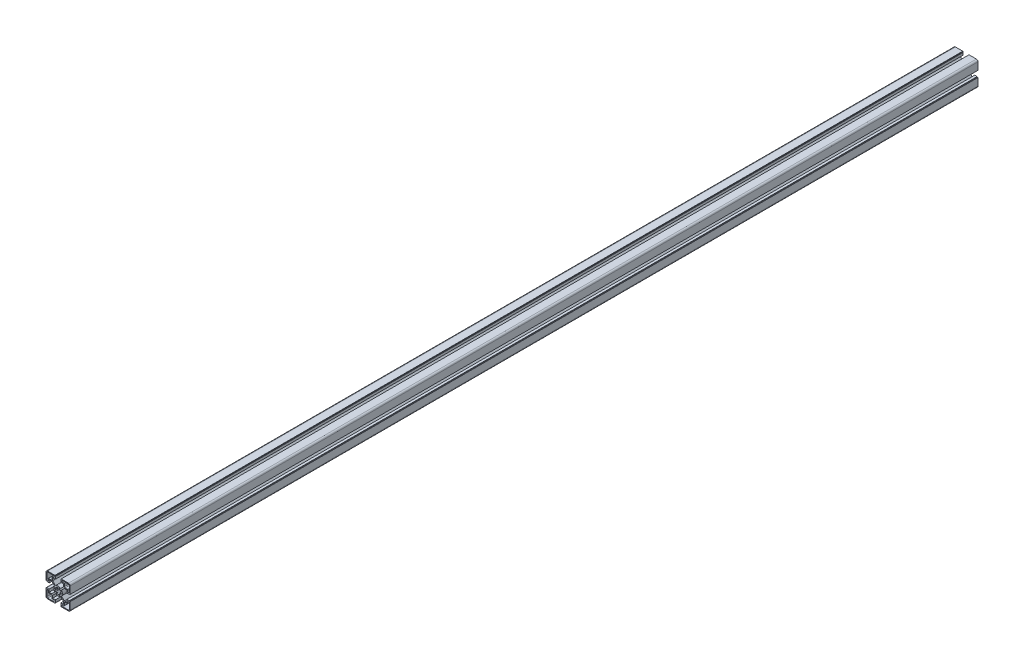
from build123d import *

# Parameters (mm, degrees)
BOSS_EXTRUDE1_DEPTH = 1691.5384


with BuildPart() as part:
    # Sketch1 → Boss-Extrude1 (new body)
    with BuildSketch(Plane.XY):
        with BuildLine():
            Line((-19.5072, 22.5044), (-5.7912, 22.5044))
            Line((-5.7912, 22.5044), (-5.7912, 21.0058))
            Line((-5.7912, 21.0058), (-5.0038, 21.0058))
            Line((-5.0038, 21.0058), (-5.0038, 16.51))
            Line((-5.0038, 16.51), (-10.0457, 16.51))
            Line((-10.0457, 16.51), (-10.0457, 11.680106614))
            Line((-10.0457, 11.680106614), (-4.781026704, 6.415433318))
            ThreePointArc((-4.781026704, 6.415433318), (0, 8.001), (4.781026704, 6.415433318))
            Line((4.781026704, 6.415433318), (10.0457, 11.680106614))
            Line((10.0457, 11.680106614), (10.0457, 16.51))
            Line((10.0457, 16.51), (5.0038, 16.51))
            Line((5.0038, 16.51), (5.0038, 21.0058))
            Line((5.0038, 21.0058), (5.7912, 21.0058))
            Line((5.7912, 21.0058), (5.7912, 22.5044))
            Line((5.7912, 22.5044), (19.5072, 22.5044))
            ThreePointArc((19.5072, 22.5044), (21.626540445, 21.626540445), (22.5044, 19.5072))
            Line((22.5044, 19.5072), (22.5044, 5.7912))
            Line((22.5044, 5.7912), (21.0058, 5.7912))
            Line((21.0058, 5.7912), (21.0058, 5.0038))
            Line((21.0058, 5.0038), (16.51, 5.0038))
            Line((16.51, 5.0038), (16.51, 10.0457))
            Line((16.51, 10.0457), (11.680106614, 10.0457))
            Line((11.680106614, 10.0457), (6.415433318, 4.781026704))
            ThreePointArc((6.415433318, 4.781026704), (8.001, 0), (6.415433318, -4.781026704))
            Line((6.415433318, -4.781026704), (11.680106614, -10.0457))
            Line((11.680106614, -10.0457), (16.51, -10.0457))
            Line((16.51, -10.0457), (16.51, -5.0038))
            Line((16.51, -5.0038), (21.0058, -5.0038))
            Line((21.0058, -5.0038), (21.0058, -5.7912))
            Line((21.0058, -5.7912), (22.5044, -5.7912))
            Line((22.5044, -5.7912), (22.5044, -19.5072))
            ThreePointArc((22.5044, -19.5072), (21.626540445, -21.626540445), (19.5072, -22.5044))
            Line((19.5072, -22.5044), (5.7912, -22.5044))
            Line((5.7912, -22.5044), (5.7912, -21.0058))
            Line((5.7912, -21.0058), (5.0038, -21.0058))
            Line((5.0038, -21.0058), (5.0038, -16.51))
            Line((5.0038, -16.51), (10.0457, -16.51))
            Line((10.0457, -16.51), (10.0457, -11.680106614))
            Line((10.0457, -11.680106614), (4.781026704, -6.415433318))
            ThreePointArc((4.781026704, -6.415433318), (0, -8.001), (-4.781026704, -6.415433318))
            Line((-4.781026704, -6.415433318), (-10.0457, -11.680106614))
            Line((-10.0457, -11.680106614), (-10.0457, -16.51))
            Line((-10.0457, -16.51), (-5.0038, -16.51))
            Line((-5.0038, -16.51), (-5.0038, -21.0058))
            Line((-5.0038, -21.0058), (-5.7912, -21.0058))
            Line((-5.7912, -21.0058), (-5.7912, -22.5044))
            Line((-5.7912, -22.5044), (-19.5072, -22.5044))
            ThreePointArc((-19.5072, -22.5044), (-21.626540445, -21.626540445), (-22.5044, -19.5072))
            Line((-22.5044, -19.5072), (-22.5044, -5.7912))
            Line((-22.5044, -5.7912), (-21.0058, -5.7912))
            Line((-21.0058, -5.7912), (-21.0058, -5.0038))
            Line((-21.0058, -5.0038), (-16.51, -5.0038))
            Line((-16.51, -5.0038), (-16.51, -10.0457))
            Line((-16.51, -10.0457), (-11.680106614, -10.0457))
            Line((-11.680106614, -10.0457), (-6.415433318, -4.781026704))
            ThreePointArc((-6.415433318, -4.781026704), (-8.001, 0), (-6.415433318, 4.781026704))
            Line((-6.415433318, 4.781026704), (-11.680106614, 10.0457))
            Line((-11.680106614, 10.0457), (-16.51, 10.0457))
            Line((-16.51, 10.0457), (-16.51, 5.0038))
            Line((-16.51, 5.0038), (-21.0058, 5.0038))
            Line((-21.0058, 5.0038), (-21.0058, 5.7912))
            Line((-21.0058, 5.7912), (-22.5044, 5.7912))
            Line((-22.5044, 5.7912), (-22.5044, 19.5072))
            ThreePointArc((-22.5044, 19.5072), (-21.626540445, 21.626540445), (-19.5072, 22.5044))
        make_face()
        with BuildLine():
            Line((-18.0086, 11.5443), (-13.0429, 11.5443))
            ThreePointArc((-13.0429, 11.5443), (-11.983229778, 11.983229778), (-11.5443, 13.0429))
            Line((-11.5443, 13.0429), (-11.5443, 18.0086))
            Line((-11.5443, 18.0086), (-8.7884, 18.0086))
            ThreePointArc((-8.7884, 18.0086), (-7.2898, 19.5072), (-8.7884, 21.0058))
            Line((-8.7884, 21.0058), (-19.5072, 21.0058))
            ThreePointArc((-19.5072, 21.0058), (-20.566870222, 20.566870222), (-21.0058, 19.5072))
            Line((-21.0058, 19.5072), (-21.0058, 8.7884))
            ThreePointArc((-21.0058, 8.7884), (-19.5072, 7.2898), (-18.0086, 8.7884))
            Line((-18.0086, 8.7884), (-18.0086, 11.5443))
        make_face(mode=Mode.SUBTRACT)
        with BuildLine():
            Line((1.189270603, 5.978867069), (0.976192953, 4.907653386))
            ThreePointArc((0.976192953, 4.907653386), (0, 5.0038), (-0.976192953, 4.907653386))
            Line((-0.976192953, 4.907653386), (-1.189270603, 5.978867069))
            ThreePointArc((-1.189270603, 5.978867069), (-2.332838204, 5.63196963), (-3.38675614, 5.068638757))
            Line((-3.38675614, 5.068638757), (-2.779962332, 4.160507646))
            ThreePointArc((-2.779962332, 4.160507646), (-3.538220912, 3.538220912), (-4.160507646, 2.779962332))
            Line((-4.160507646, 2.779962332), (-5.068638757, 3.38675614))
            ThreePointArc((-5.068638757, 3.38675614), (-5.63196963, 2.332838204), (-5.978867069, 1.189270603))
            Line((-5.978867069, 1.189270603), (-4.907653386, 0.976192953))
            ThreePointArc((-4.907653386, 0.976192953), (-5.0038, 0), (-4.907653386, -0.976192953))
            Line((-4.907653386, -0.976192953), (-5.978867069, -1.189270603))
            ThreePointArc((-5.978867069, -1.189270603), (-5.63196963, -2.332838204), (-5.068638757, -3.38675614))
            Line((-5.068638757, -3.38675614), (-4.160507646, -2.779962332))
            ThreePointArc((-4.160507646, -2.779962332), (-3.538220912, -3.538220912), (-2.779962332, -4.160507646))
            Line((-2.779962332, -4.160507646), (-3.38675614, -5.068638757))
            ThreePointArc((-3.38675614, -5.068638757), (-2.332838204, -5.63196963), (-1.189270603, -5.978867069))
            Line((-1.189270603, -5.978867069), (-0.976192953, -4.907653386))
            ThreePointArc((-0.976192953, -4.907653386), (0, -5.0038), (0.976192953, -4.907653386))
            Line((0.976192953, -4.907653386), (1.189270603, -5.978867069))
            ThreePointArc((1.189270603, -5.978867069), (2.332838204, -5.63196963), (3.38675614, -5.068638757))
            Line((3.38675614, -5.068638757), (2.779962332, -4.160507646))
            ThreePointArc((2.779962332, -4.160507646), (3.538220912, -3.538220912), (4.160507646, -2.779962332))
            Line((4.160507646, -2.779962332), (5.068638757, -3.38675614))
            ThreePointArc((5.068638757, -3.38675614), (5.63196963, -2.332838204), (5.978867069, -1.189270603))
            Line((5.978867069, -1.189270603), (4.907653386, -0.976192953))
            ThreePointArc((4.907653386, -0.976192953), (5.0038, 0), (4.907653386, 0.976192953))
            Line((4.907653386, 0.976192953), (5.978867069, 1.189270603))
            ThreePointArc((5.978867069, 1.189270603), (5.63196963, 2.332838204), (5.068638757, 3.38675614))
            Line((5.068638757, 3.38675614), (4.160507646, 2.779962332))
            ThreePointArc((4.160507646, 2.779962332), (3.538220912, 3.538220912), (2.779962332, 4.160507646))
            Line((2.779962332, 4.160507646), (3.38675614, 5.068638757))
            ThreePointArc((3.38675614, 5.068638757), (2.332838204, 5.63196963), (1.189270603, 5.978867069))
        make_face(mode=Mode.SUBTRACT)
        with BuildLine():
            Line((11.5443, 18.0086), (8.7884, 18.0086))
            ThreePointArc((8.7884, 18.0086), (7.2898, 19.5072), (8.7884, 21.0058))
            Line((8.7884, 21.0058), (19.5072, 21.0058))
            ThreePointArc((19.5072, 21.0058), (20.566870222, 20.566870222), (21.0058, 19.5072))
            Line((21.0058, 19.5072), (21.0058, 8.7884))
            ThreePointArc((21.0058, 8.7884), (19.5072, 7.2898), (18.0086, 8.7884))
            Line((18.0086, 8.7884), (18.0086, 11.5443))
            Line((18.0086, 11.5443), (13.0429, 11.5443))
            ThreePointArc((13.0429, 11.5443), (11.983229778, 11.983229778), (11.5443, 13.0429))
            Line((11.5443, 13.0429), (11.5443, 18.0086))
        make_face(mode=Mode.SUBTRACT)
        with BuildLine():
            Line((18.0086, -11.5443), (13.0429, -11.5443))
            ThreePointArc((13.0429, -11.5443), (11.983229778, -11.983229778), (11.5443, -13.0429))
            Line((11.5443, -13.0429), (11.5443, -18.0086))
            Line((11.5443, -18.0086), (8.7884, -18.0086))
            ThreePointArc((8.7884, -18.0086), (7.2898, -19.5072), (8.7884, -21.0058))
            Line((8.7884, -21.0058), (19.5072, -21.0058))
            ThreePointArc((19.5072, -21.0058), (20.566870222, -20.566870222), (21.0058, -19.5072))
            Line((21.0058, -19.5072), (21.0058, -8.7884))
            ThreePointArc((21.0058, -8.7884), (19.5072, -7.2898), (18.0086, -8.7884))
            Line((18.0086, -8.7884), (18.0086, -11.5443))
        make_face(mode=Mode.SUBTRACT)
        with BuildLine():
            Line((-11.5443, -18.0086), (-8.7884, -18.0086))
            ThreePointArc((-8.7884, -18.0086), (-7.2898, -19.5072), (-8.7884, -21.0058))
            Line((-8.7884, -21.0058), (-19.5072, -21.0058))
            ThreePointArc((-19.5072, -21.0058), (-20.566870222, -20.566870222), (-21.0058, -19.5072))
            Line((-21.0058, -19.5072), (-21.0058, -8.7884))
            ThreePointArc((-21.0058, -8.7884), (-19.5072, -7.2898), (-18.0086, -8.7884))
            Line((-18.0086, -8.7884), (-18.0086, -11.5443))
            Line((-18.0086, -11.5443), (-13.0429, -11.5443))
            ThreePointArc((-13.0429, -11.5443), (-11.983229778, -11.983229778), (-11.5443, -13.0429))
            Line((-11.5443, -13.0429), (-11.5443, -18.0086))
        make_face(mode=Mode.SUBTRACT)
    extrude(amount=BOSS_EXTRUDE1_DEPTH)


solid = part.part
